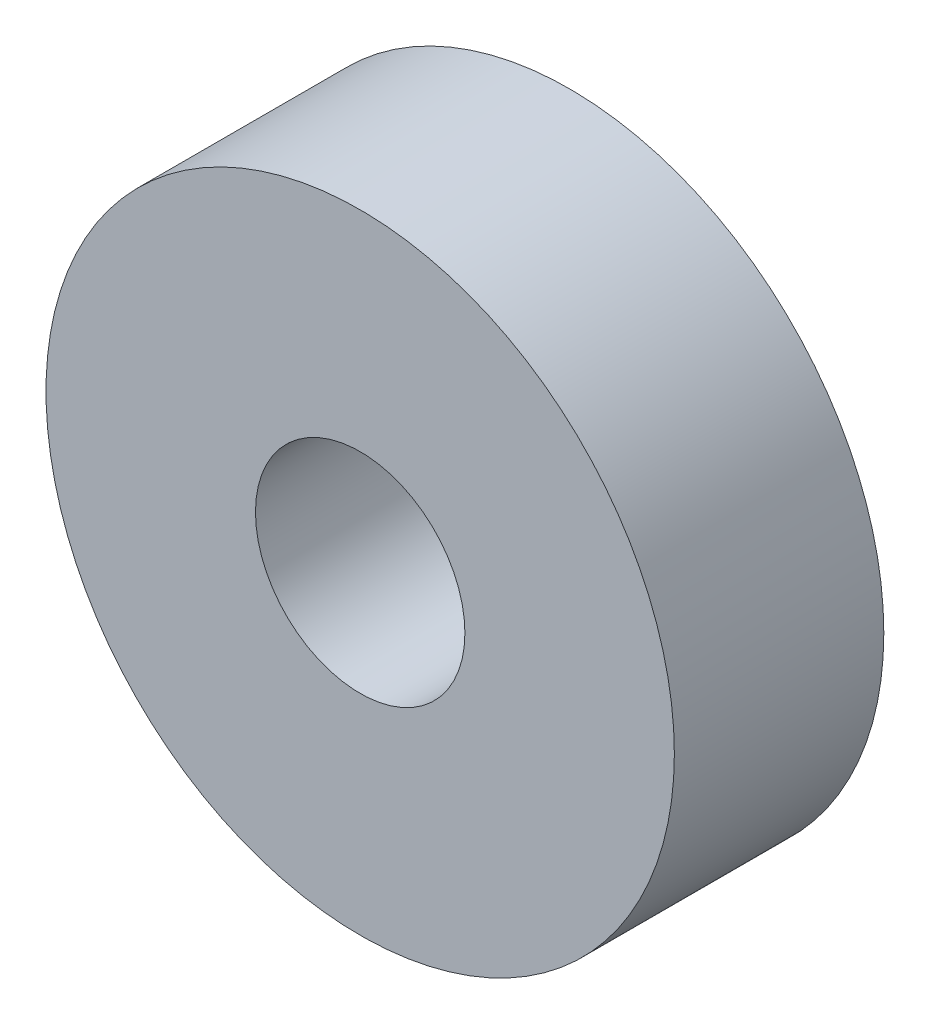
from build123d import *

# Parameters (mm, degrees)
SKETCH_1_R          = 6
EXTRUDE_1_DEPTH     = 4
SKETCH_2_R          = 2
CUT_EXTRUDE_2_DEPTH = 10.38083152


with BuildPart() as part:
    # Sketch 1 → Extrude 1 (new body)
    with BuildSketch(Plane.XY):
        Circle(SKETCH_1_R)
    extrude(amount=EXTRUDE_1_DEPTH)

    # Sketch 2 → Cut-Extrude 2 (cut, through all)
    with BuildSketch(Plane.XY):
        Circle(SKETCH_2_R)
    extrude(amount=CUT_EXTRUDE_2_DEPTH, mode=Mode.SUBTRACT)


solid = part.part
